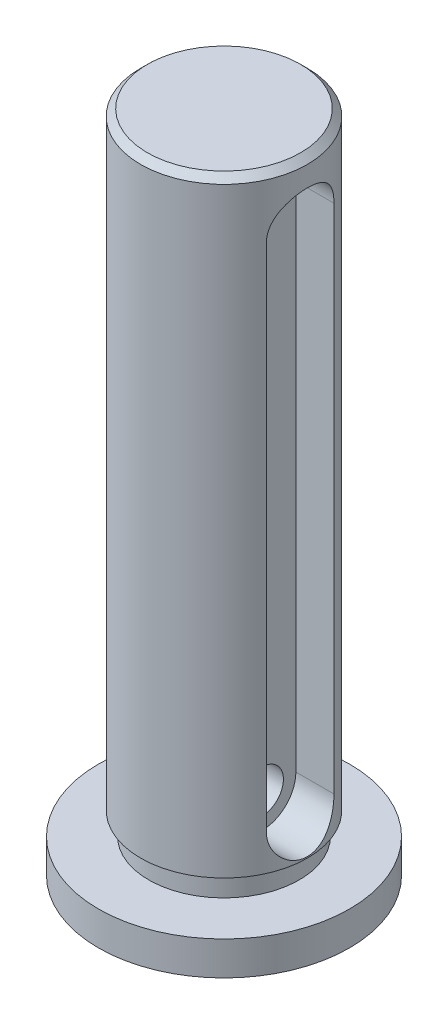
from build123d import *

# Parameters (mm, degrees)
CUT_EXTRUDE2_DEPTH      = 1.016
CUT_EXTRUDE2_DEPTH_BACK = 1.397
SKETCH4_R               = 0.8001
CUT_EXTRUDE4_DEPTH      = 1.1176
CHAMFER2_SIZE           = 0.254


with BuildPart() as part:
    # Sketch1 → Revolve1 (revolve)
    with BuildSketch(Plane.XY, mode=Mode.PRIVATE) as revolve1_sk:
        with BuildLine():
            Line((4.7244, 0.8128), (4.7244, 2.0828))
            Line((4.7244, 2.0828), (2.8321, 2.0828))
            Line((2.8321, 2.0828), (2.8321, 2.9464))
            Line((2.8321, 2.9464), (3.1369, 2.9464))
            Line((3.1369, 2.9464), (3.1369, 25.8064))
            Line((3.1369, 25.8064), (0, 25.8064))
            Line((0, 25.8064), (0, 0))
            ThreePointArc((0, 0), (2.396904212, 0.20468177), (4.7244, 0.8128))
        make_face()
    revolve(revolve1_sk.sketch.rotate(Axis((0, 12.9032, 0), (0, -1, 0)), 180), axis=Axis((0, 12.9032, 0), (0, -1, 0)))

    # Sketch3 → Cut-Extrude2 (cut, two sides: drawn at the far end of the back side and taken through both)
    with BuildSketch(Plane(origin=(2.8321, 0, 0), x_dir=(0, 0, -1), z_dir=(1, 0, 0)).offset(-CUT_EXTRUDE2_DEPTH_BACK)):
        with BuildLine():
            Line((1.27, 23.5204), (1.27, 4.2672))
            ThreePointArc((1.27, 4.2672), (0, 2.9972), (-1.27, 4.2672))
            Line((-1.27, 4.2672), (-1.27, 23.5204))
            ThreePointArc((-1.27, 23.5204), (0, 24.7904), (1.27, 23.5204))
        make_face()
    extrude(amount=CUT_EXTRUDE2_DEPTH + CUT_EXTRUDE2_DEPTH_BACK, mode=Mode.SUBTRACT)

    # Sketch4 → Cut-Extrude4 (cut)
    with BuildSketch(Plane(origin=(1.4351, 0, 0), x_dir=(0, 0, -1), z_dir=(1, 0, 0))):
        with Locations(Location((0, 23.5204, 0), (0, 0, 90))):
            Circle(SKETCH4_R)
        with Locations(Location((0, 4.2672, 0), (0, 0, 90))):
            Circle(SKETCH4_R)
    extrude(amount=-CUT_EXTRUDE4_DEPTH, mode=Mode.SUBTRACT)

    # Chamfer2
    chamfer2_edges = [part.edges().sort_by_distance(p)[0] for p in [
        (3.1369, 25.8064, 0),
    ]]
    chamfer(chamfer2_edges, length=CHAMFER2_SIZE)


solid = part.part
